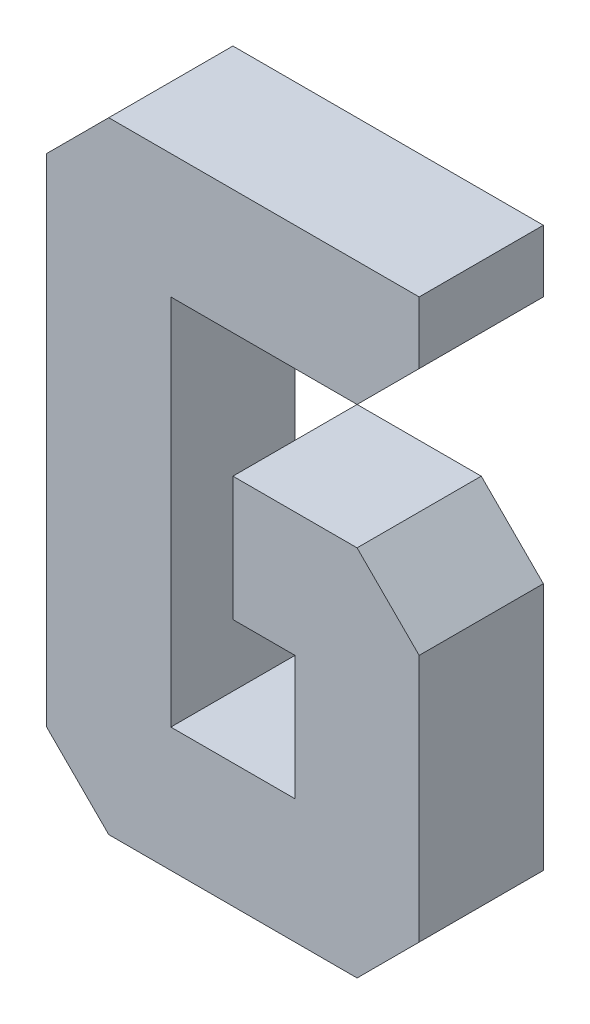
from build123d import *

# Parameters (mm, degrees)
BOSS_EXTRU_1_DEPTH = 10
CHANFREIN1_SIZE    = 5
CHANFREIN2_SIZE    = 5
CHANFREIN3_SIZE    = 5
CHANFREIN4_SIZE    = 5
CHANFREIN5_SIZE    = 5


with BuildPart() as part:
    # Esquisse1 → Boss.-Extru.1 (new body)
    with BuildSketch(Plane.XY):
        Polygon((0, 10), (0, 0), (10, 0), (30, 0), (30, 10), (30, 30), (20, 30), (15, 30), (15, 20), (20, 20), (20, 10), (10, 10), (10, 40), (30, 40), (30, 50), (10, 50), (0, 50), (0, 40), align=None)
    extrude(amount=BOSS_EXTRU_1_DEPTH)

    # Chanfrein1
    chanfrein1_edges = [part.edges().sort_by_distance(p)[0] for p in [
        (30, 30, 5),
    ]]
    chamfer(chanfrein1_edges, length=CHANFREIN1_SIZE)

    # Chanfrein2
    chanfrein2_edges = [part.edges().sort_by_distance(p)[0] for p in [
        (30, 0, 5),
    ]]
    chamfer(chanfrein2_edges, length=CHANFREIN2_SIZE)

    # Chanfrein3
    chanfrein3_edges = [part.edges().sort_by_distance(p)[0] for p in [
        (0, 50, 5),
    ]]
    chamfer(chanfrein3_edges, length=CHANFREIN3_SIZE)

    # Chanfrein4
    chanfrein4_edges = [part.edges().sort_by_distance(p)[0] for p in [
        (30, 40, 5),
    ]]
    chamfer(chanfrein4_edges, length=CHANFREIN4_SIZE)

    # Chanfrein5
    chanfrein5_edges = [part.edges().sort_by_distance(p)[0] for p in [
        (0, 0, 5),
    ]]
    chamfer(chanfrein5_edges, length=CHANFREIN5_SIZE)


solid = part.part
